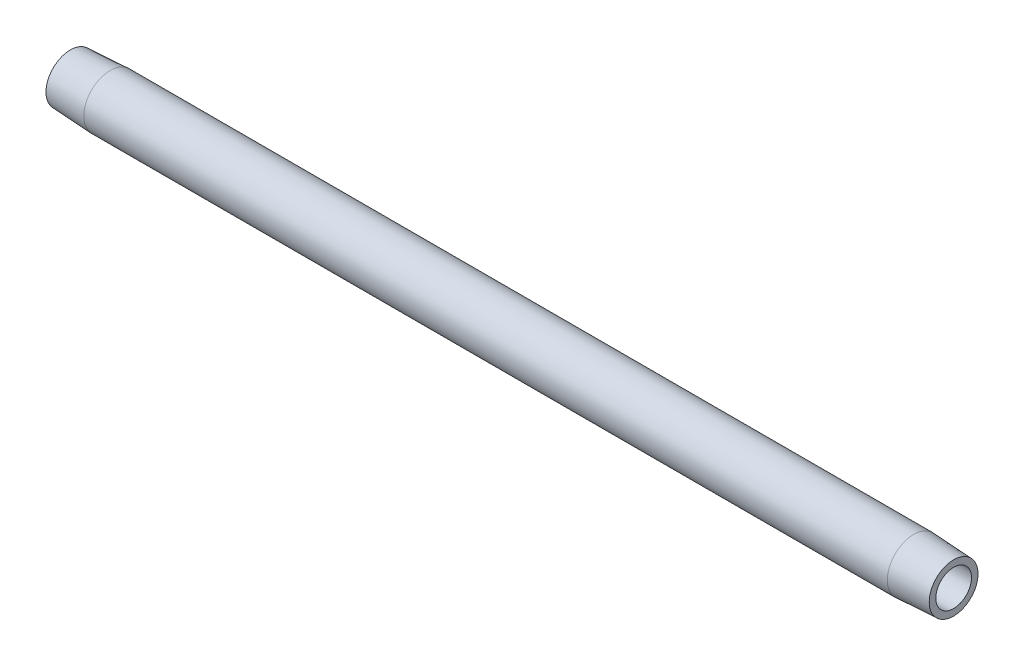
from build123d import *


with BuildPart() as part:
    # Sketch1 → Revolve1 (revolve)
    with BuildSketch(Plane(origin=(0, 0, 0), x_dir=(1, 0, 0), z_dir=(0, 1, 0)), mode=Mode.PRIVATE) as revolve1_sk:
        Polygon((228.6, 4.622776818), (0, 4.622776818), (0, 6.317526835), (10.3124, 6.857976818), (218.2876, 6.857976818), (228.6, 6.317526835), align=None)
    revolve(revolve1_sk.sketch.rotate(Axis((-6.375994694, 0, 0), (1, 0, 0)), 180), axis=Axis((-6.375994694, 0, 0), (1, 0, 0)))


solid = part.part
